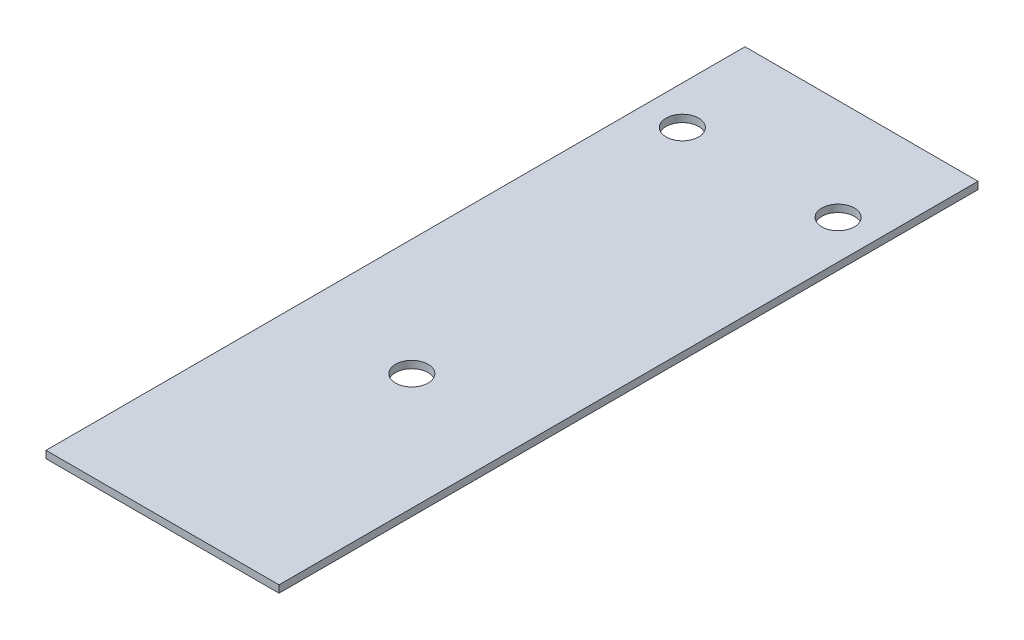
ISO-10303-21;
HEADER;
FILE_DESCRIPTION(('STEP AP214'),'2;1');
FILE_NAME('part.step','',(''),(''),'','','');
FILE_SCHEMA(('AUTOMOTIVE_DESIGN { 1 0 10303 214 1 1 1 1 }'));
ENDSEC;
DATA;
#1=APPLICATION_CONTEXT('core data for automotive mechanical design processes');
#2=APPLICATION_PROTOCOL_DEFINITION('international standard','automotive_design',2000,#1);
#3=PRODUCT_CONTEXT('',#1,'mechanical');
#4=PRODUCT('Part','Part','',(#3));
#5=PRODUCT_RELATED_PRODUCT_CATEGORY('part','',(#4));
#6=PRODUCT_DEFINITION_FORMATION('','',#4);
#7=PRODUCT_DEFINITION_CONTEXT('part definition',#1,'design');
#8=PRODUCT_DEFINITION('design','',#6,#7);
#9=PRODUCT_DEFINITION_SHAPE('','',#8);
#10=(LENGTH_UNIT() NAMED_UNIT(*) SI_UNIT(.MILLI.,.METRE.));
#11=(NAMED_UNIT(*) PLANE_ANGLE_UNIT() SI_UNIT($,.RADIAN.));
#12=(NAMED_UNIT(*) SI_UNIT($,.STERADIAN.) SOLID_ANGLE_UNIT());
#13=UNCERTAINTY_MEASURE_WITH_UNIT(LENGTH_MEASURE(1.E-05),#10,'distance_accuracy_value','');
#14=(GEOMETRIC_REPRESENTATION_CONTEXT(3) GLOBAL_UNCERTAINTY_ASSIGNED_CONTEXT((#13)) GLOBAL_UNIT_ASSIGNED_CONTEXT((#10,
#11,#12)) REPRESENTATION_CONTEXT('',''));
#15=CARTESIAN_POINT('',(0.,0.,0.));
#16=DIRECTION('',(0.,0.,1.));
#17=DIRECTION('',(1.,0.,0.));
#18=AXIS2_PLACEMENT_3D('',#15,#16,#17);
#19=CARTESIAN_POINT('',(76.2,4.7625,228.6));
#20=DIRECTION('',(-1.,0.,0.));
#21=DIRECTION('',(0.,0.,1.));
#22=AXIS2_PLACEMENT_3D('',#19,#20,#21);
#23=PLANE('',#22);
#24=DIRECTION('',(0.,0.,-1.));
#25=VECTOR('',#24,1.);
#26=CARTESIAN_POINT('',(76.2,0.,228.6));
#27=LINE('',#26,#25);
#28=CARTESIAN_POINT('',(76.2,0.,228.6));
#29=VERTEX_POINT('',#28);
#30=CARTESIAN_POINT('',(76.2,0.,-228.6));
#31=VERTEX_POINT('',#30);
#32=EDGE_CURVE('E111',#29,#31,#27,.T.);
#33=ORIENTED_EDGE('',*,*,#32,.T.);
#34=DIRECTION('',(0.,-1.,0.));
#35=VECTOR('',#34,1.);
#36=CARTESIAN_POINT('',(76.2,4.7625,-228.6));
#37=LINE('',#36,#35);
#38=CARTESIAN_POINT('',(76.2,4.7625,-228.6));
#39=VERTEX_POINT('',#38);
#40=EDGE_CURVE('E11',#39,#31,#37,.T.);
#41=ORIENTED_EDGE('',*,*,#40,.F.);
#42=DIRECTION('',(0.,0.,-1.));
#43=VECTOR('',#42,1.);
#44=CARTESIAN_POINT('',(76.2,4.7625,228.6));
#45=LINE('',#44,#43);
#46=CARTESIAN_POINT('',(76.2,4.7625,228.6));
#47=VERTEX_POINT('',#46);
#48=EDGE_CURVE('E95',#47,#39,#45,.T.);
#49=ORIENTED_EDGE('',*,*,#48,.F.);
#50=DIRECTION('',(0.,-1.,0.));
#51=VECTOR('',#50,1.);
#52=CARTESIAN_POINT('',(76.2,4.7625,228.6));
#53=LINE('',#52,#51);
#54=EDGE_CURVE('E107',#47,#29,#53,.T.);
#55=ORIENTED_EDGE('',*,*,#54,.T.);
#56=EDGE_LOOP('',(#33,#41,#49,#55));
#57=FACE_BOUND('',#56,.T.);
#58=ADVANCED_FACE('F43',(#57),#23,.F.);
#59=CARTESIAN_POINT('',(-76.2,4.7625,-228.6));
#60=DIRECTION('',(0.,0.,1.));
#61=DIRECTION('',(1.,0.,0.));
#62=AXIS2_PLACEMENT_3D('',#59,#60,#61);
#63=PLANE('',#62);
#64=DIRECTION('',(-1.,0.,0.));
#65=VECTOR('',#64,1.);
#66=CARTESIAN_POINT('',(-76.2,0.,-228.6));
#67=LINE('',#66,#65);
#68=CARTESIAN_POINT('',(-76.2,0.,-228.6));
#69=VERTEX_POINT('',#68);
#70=EDGE_CURVE('E100',#31,#69,#67,.T.);
#71=ORIENTED_EDGE('',*,*,#70,.T.);
#72=DIRECTION('',(0.,-1.,0.));
#73=VECTOR('',#72,1.);
#74=CARTESIAN_POINT('',(-76.2,4.7625,-228.6));
#75=LINE('',#74,#73);
#76=CARTESIAN_POINT('',(-76.2,4.7625,-228.6));
#77=VERTEX_POINT('',#76);
#78=EDGE_CURVE('E52',#77,#69,#75,.T.);
#79=ORIENTED_EDGE('',*,*,#78,.F.);
#80=DIRECTION('',(-1.,0.,0.));
#81=VECTOR('',#80,1.);
#82=CARTESIAN_POINT('',(-76.2,4.7625,-228.6));
#83=LINE('',#82,#81);
#84=EDGE_CURVE('E90',#39,#77,#83,.T.);
#85=ORIENTED_EDGE('',*,*,#84,.F.);
#86=ORIENTED_EDGE('',*,*,#40,.T.);
#87=EDGE_LOOP('',(#71,#79,#85,#86));
#88=FACE_BOUND('',#87,.T.);
#89=ADVANCED_FACE('F99',(#88),#63,.F.);
#90=CARTESIAN_POINT('',(-76.2,4.7625,228.6));
#91=DIRECTION('',(1.,0.,0.));
#92=DIRECTION('',(0.,0.,-1.));
#93=AXIS2_PLACEMENT_3D('',#90,#91,#92);
#94=PLANE('',#93);
#95=DIRECTION('',(0.,0.,1.));
#96=VECTOR('',#95,1.);
#97=CARTESIAN_POINT('',(-76.2,0.,228.6));
#98=LINE('',#97,#96);
#99=CARTESIAN_POINT('',(-76.2,0.,228.6));
#100=VERTEX_POINT('',#99);
#101=EDGE_CURVE('E77',#69,#100,#98,.T.);
#102=ORIENTED_EDGE('',*,*,#101,.T.);
#103=DIRECTION('',(0.,-1.,0.));
#104=VECTOR('',#103,1.);
#105=CARTESIAN_POINT('',(-76.2,4.7625,228.6));
#106=LINE('',#105,#104);
#107=CARTESIAN_POINT('',(-76.2,4.7625,228.6));
#108=VERTEX_POINT('',#107);
#109=EDGE_CURVE('E102',#108,#100,#106,.T.);
#110=ORIENTED_EDGE('',*,*,#109,.F.);
#111=DIRECTION('',(0.,0.,1.));
#112=VECTOR('',#111,1.);
#113=CARTESIAN_POINT('',(-76.2,4.7625,228.6));
#114=LINE('',#113,#112);
#115=EDGE_CURVE('E93',#77,#108,#114,.T.);
#116=ORIENTED_EDGE('',*,*,#115,.F.);
#117=ORIENTED_EDGE('',*,*,#78,.T.);
#118=EDGE_LOOP('',(#102,#110,#116,#117));
#119=FACE_BOUND('',#118,.T.);
#120=ADVANCED_FACE('F103',(#119),#94,.F.);
#121=CARTESIAN_POINT('',(-76.2,4.7625,228.6));
#122=DIRECTION('',(0.,0.,-1.));
#123=DIRECTION('',(-1.,0.,0.));
#124=AXIS2_PLACEMENT_3D('',#121,#122,#123);
#125=PLANE('',#124);
#126=DIRECTION('',(1.,0.,0.));
#127=VECTOR('',#126,1.);
#128=CARTESIAN_POINT('',(-76.2,0.,228.6));
#129=LINE('',#128,#127);
#130=EDGE_CURVE('E83',#100,#29,#129,.T.);
#131=ORIENTED_EDGE('',*,*,#130,.T.);
#132=ORIENTED_EDGE('',*,*,#54,.F.);
#133=DIRECTION('',(1.,0.,0.));
#134=VECTOR('',#133,1.);
#135=CARTESIAN_POINT('',(-76.2,4.7625,228.6));
#136=LINE('',#135,#134);
#137=EDGE_CURVE('E60',#108,#47,#136,.T.);
#138=ORIENTED_EDGE('',*,*,#137,.F.);
#139=ORIENTED_EDGE('',*,*,#109,.T.);
#140=EDGE_LOOP('',(#131,#132,#138,#139));
#141=FACE_BOUND('',#140,.T.);
#142=ADVANCED_FACE('F125',(#141),#125,.F.);
#143=CARTESIAN_POINT('',(0.,4.7625,0.));
#144=DIRECTION('',(0.,-1.,0.));
#145=DIRECTION('',(0.,0.,-1.));
#146=AXIS2_PLACEMENT_3D('',#143,#144,#145);
#147=PLANE('',#146);
#148=CARTESIAN_POINT('',(-50.927,4.7625,-162.3695));
#149=DIRECTION('',(0.,1.,0.));
#150=DIRECTION('',(0.,0.,1.));
#151=AXIS2_PLACEMENT_3D('',#148,#149,#150);
#152=CIRCLE('',#151,10.668);
#153=CARTESIAN_POINT('',(-50.927,4.7625,-151.7015));
#154=VERTEX_POINT('',#153);
#155=EDGE_CURVE('E148',#154,#154,#152,.T.);
#156=ORIENTED_EDGE('',*,*,#155,.F.);
#157=EDGE_LOOP('',(#156));
#158=FACE_BOUND('',#157,.T.);
#159=CARTESIAN_POINT('',(50.927,4.7625,-162.3695));
#160=DIRECTION('',(0.,1.,0.));
#161=DIRECTION('',(0.,0.,1.));
#162=AXIS2_PLACEMENT_3D('',#159,#160,#161);
#163=CIRCLE('',#162,10.668);
#164=CARTESIAN_POINT('',(50.927,4.7625,-151.7015));
#165=VERTEX_POINT('',#164);
#166=EDGE_CURVE('E144',#165,#165,#163,.T.);
#167=ORIENTED_EDGE('',*,*,#166,.F.);
#168=EDGE_LOOP('',(#167));
#169=FACE_BOUND('',#168,.T.);
#170=CARTESIAN_POINT('',(0.,4.7625,65.5320000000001));
#171=DIRECTION('',(0.,1.,0.));
#172=DIRECTION('',(0.,0.,1.));
#173=AXIS2_PLACEMENT_3D('',#170,#171,#172);
#174=CIRCLE('',#173,10.668);
#175=CARTESIAN_POINT('',(0.,4.7625,76.2000000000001));
#176=VERTEX_POINT('',#175);
#177=EDGE_CURVE('E136',#176,#176,#174,.T.);
#178=ORIENTED_EDGE('',*,*,#177,.F.);
#179=EDGE_LOOP('',(#178));
#180=FACE_BOUND('',#179,.T.);
#181=ORIENTED_EDGE('',*,*,#48,.T.);
#182=ORIENTED_EDGE('',*,*,#84,.T.);
#183=ORIENTED_EDGE('',*,*,#115,.T.);
#184=ORIENTED_EDGE('',*,*,#137,.T.);
#185=EDGE_LOOP('',(#181,#182,#183,#184));
#186=FACE_BOUND('',#185,.T.);
#187=ADVANCED_FACE('F91',(#158,#169,#180,#186),#147,.F.);
#188=CARTESIAN_POINT('',(0.,0.,0.));
#189=DIRECTION('',(0.,-1.,0.));
#190=DIRECTION('',(0.,0.,-1.));
#191=AXIS2_PLACEMENT_3D('',#188,#189,#190);
#192=PLANE('',#191);
#193=CARTESIAN_POINT('',(-50.927,0.,-162.3695));
#194=DIRECTION('',(0.,1.,0.));
#195=DIRECTION('',(0.,0.,1.));
#196=AXIS2_PLACEMENT_3D('',#193,#194,#195);
#197=CIRCLE('',#196,10.668);
#198=CARTESIAN_POINT('',(-50.927,0.,-151.7015));
#199=VERTEX_POINT('',#198);
#200=EDGE_CURVE('E115',#199,#199,#197,.T.);
#201=ORIENTED_EDGE('',*,*,#200,.T.);
#202=EDGE_LOOP('',(#201));
#203=FACE_BOUND('',#202,.T.);
#204=CARTESIAN_POINT('',(50.927,0.,-162.3695));
#205=DIRECTION('',(0.,1.,0.));
#206=DIRECTION('',(0.,0.,1.));
#207=AXIS2_PLACEMENT_3D('',#204,#205,#206);
#208=CIRCLE('',#207,10.668);
#209=CARTESIAN_POINT('',(50.927,0.,-151.7015));
#210=VERTEX_POINT('',#209);
#211=EDGE_CURVE('E140',#210,#210,#208,.T.);
#212=ORIENTED_EDGE('',*,*,#211,.T.);
#213=EDGE_LOOP('',(#212));
#214=FACE_BOUND('',#213,.T.);
#215=CARTESIAN_POINT('',(0.,0.,65.5320000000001));
#216=DIRECTION('',(0.,1.,0.));
#217=DIRECTION('',(0.,0.,1.));
#218=AXIS2_PLACEMENT_3D('',#215,#216,#217);
#219=CIRCLE('',#218,10.668);
#220=CARTESIAN_POINT('',(0.,0.,76.2000000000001));
#221=VERTEX_POINT('',#220);
#222=EDGE_CURVE('E132',#221,#221,#219,.T.);
#223=ORIENTED_EDGE('',*,*,#222,.T.);
#224=EDGE_LOOP('',(#223));
#225=FACE_BOUND('',#224,.T.);
#226=ORIENTED_EDGE('',*,*,#32,.F.);
#227=ORIENTED_EDGE('',*,*,#130,.F.);
#228=ORIENTED_EDGE('',*,*,#101,.F.);
#229=ORIENTED_EDGE('',*,*,#70,.F.);
#230=EDGE_LOOP('',(#226,#227,#228,#229));
#231=FACE_BOUND('',#230,.T.);
#232=ADVANCED_FACE('F128',(#203,#214,#225,#231),#192,.T.);
#233=CARTESIAN_POINT('',(0.,0.,65.5320000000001));
#234=DIRECTION('',(0.,1.,0.));
#235=DIRECTION('',(0.,0.,1.));
#236=AXIS2_PLACEMENT_3D('',#233,#234,#235);
#237=CYLINDRICAL_SURFACE('',#236,10.668);
#238=CARTESIAN_POINT('',(0.,0.,76.2000000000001));
#239=CARTESIAN_POINT('',(0.,0.049609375,76.2000000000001));
#240=CARTESIAN_POINT('',(0.,0.09921875,76.2000000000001));
#241=CARTESIAN_POINT('',(0.,0.1984375,76.2000000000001));
#242=CARTESIAN_POINT('',(0.,0.248046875,76.2000000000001));
#243=CARTESIAN_POINT('',(0.,0.347265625,76.2000000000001));
#244=CARTESIAN_POINT('',(0.,0.396875,76.2000000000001));
#245=CARTESIAN_POINT('',(0.,0.49609375,76.2000000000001));
#246=CARTESIAN_POINT('',(0.,0.545703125,76.2000000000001));
#247=CARTESIAN_POINT('',(0.,0.644921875,76.2000000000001));
#248=CARTESIAN_POINT('',(0.,0.69453125,76.2000000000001));
#249=CARTESIAN_POINT('',(0.,0.79375,76.2000000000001));
#250=CARTESIAN_POINT('',(0.,0.843359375,76.2000000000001));
#251=CARTESIAN_POINT('',(0.,0.942578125,76.2000000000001));
#252=CARTESIAN_POINT('',(0.,0.9921875,76.2000000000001));
#253=CARTESIAN_POINT('',(0.,1.09140625,76.2000000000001));
#254=CARTESIAN_POINT('',(0.,1.141015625,76.2000000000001));
#255=CARTESIAN_POINT('',(0.,1.240234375,76.2000000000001));
#256=CARTESIAN_POINT('',(0.,1.28984375,76.2000000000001));
#257=CARTESIAN_POINT('',(0.,1.3890625,76.2000000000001));
#258=CARTESIAN_POINT('',(0.,1.438671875,76.2000000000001));
#259=CARTESIAN_POINT('',(0.,1.537890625,76.2000000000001));
#260=CARTESIAN_POINT('',(0.,1.5875,76.2000000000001));
#261=CARTESIAN_POINT('',(0.,1.68671875,76.2000000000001));
#262=CARTESIAN_POINT('',(0.,1.736328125,76.2000000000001));
#263=CARTESIAN_POINT('',(0.,1.835546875,76.2000000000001));
#264=CARTESIAN_POINT('',(0.,1.88515625,76.2000000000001));
#265=CARTESIAN_POINT('',(0.,1.984375,76.2000000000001));
#266=CARTESIAN_POINT('',(0.,2.033984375,76.2000000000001));
#267=CARTESIAN_POINT('',(0.,2.133203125,76.2000000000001));
#268=CARTESIAN_POINT('',(0.,2.1828125,76.2000000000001));
#269=CARTESIAN_POINT('',(0.,2.28203125,76.2000000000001));
#270=CARTESIAN_POINT('',(0.,2.331640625,76.2000000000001));
#271=CARTESIAN_POINT('',(0.,2.430859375,76.2000000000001));
#272=CARTESIAN_POINT('',(0.,2.48046875,76.2000000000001));
#273=CARTESIAN_POINT('',(0.,2.5796875,76.2000000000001));
#274=CARTESIAN_POINT('',(0.,2.629296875,76.2000000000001));
#275=CARTESIAN_POINT('',(0.,2.728515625,76.2000000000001));
#276=CARTESIAN_POINT('',(0.,2.778125,76.2000000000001));
#277=CARTESIAN_POINT('',(0.,2.87734375,76.2000000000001));
#278=CARTESIAN_POINT('',(0.,2.926953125,76.2000000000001));
#279=CARTESIAN_POINT('',(0.,3.026171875,76.2000000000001));
#280=CARTESIAN_POINT('',(0.,3.07578125,76.2000000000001));
#281=CARTESIAN_POINT('',(0.,3.175,76.2000000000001));
#282=CARTESIAN_POINT('',(0.,3.224609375,76.2000000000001));
#283=CARTESIAN_POINT('',(0.,3.323828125,76.2000000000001));
#284=CARTESIAN_POINT('',(0.,3.3734375,76.2000000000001));
#285=CARTESIAN_POINT('',(0.,3.47265625,76.2000000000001));
#286=CARTESIAN_POINT('',(0.,3.522265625,76.2000000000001));
#287=CARTESIAN_POINT('',(0.,3.621484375,76.2000000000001));
#288=CARTESIAN_POINT('',(0.,3.67109375,76.2000000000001));
#289=CARTESIAN_POINT('',(0.,3.7703125,76.2000000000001));
#290=CARTESIAN_POINT('',(0.,3.819921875,76.2000000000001));
#291=CARTESIAN_POINT('',(0.,3.919140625,76.2000000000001));
#292=CARTESIAN_POINT('',(0.,3.96875,76.2000000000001));
#293=CARTESIAN_POINT('',(0.,4.06796875,76.2000000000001));
#294=CARTESIAN_POINT('',(0.,4.117578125,76.2000000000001));
#295=CARTESIAN_POINT('',(0.,4.216796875,76.2000000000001));
#296=CARTESIAN_POINT('',(0.,4.26640625,76.2000000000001));
#297=CARTESIAN_POINT('',(0.,4.365625,76.2000000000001));
#298=CARTESIAN_POINT('',(0.,4.415234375,76.2000000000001));
#299=CARTESIAN_POINT('',(0.,4.514453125,76.2000000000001));
#300=CARTESIAN_POINT('',(0.,4.5640625,76.2000000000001));
#301=CARTESIAN_POINT('',(0.,4.66328125,76.2000000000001));
#302=CARTESIAN_POINT('',(0.,4.712890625,76.2000000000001));
#303=CARTESIAN_POINT('',(0.,4.7625,76.2000000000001));
#304=B_SPLINE_CURVE_WITH_KNOTS('',3,(#238,#239,#240,#241,#242,#243,#244,#245,#246,#247,#248,
#249,#250,#251,#252,#253,#254,#255,#256,#257,#258,#259,#260,#261,#262,#263,#264,#265,#266,#267,
#268,#269,#270,#271,#272,#273,#274,#275,#276,#277,#278,#279,#280,#281,#282,#283,#284,#285,#286,
#287,#288,#289,#290,#291,#292,#293,#294,#295,#296,#297,#298,#299,#300,#301,#302,#303),
.UNSPECIFIED.,.F.,.F.,(4,2,2,2,2,2,2,2,2,2,2,2,2,2,2,2,2,2,2,2,2,2,2,2,2,2,2,2,2,2,2,2,4),(0.,
0.148828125,0.29765625,0.446484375,0.5953125,0.744140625,0.89296875,1.041796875,1.190625,
1.339453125,1.48828125,1.637109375,1.7859375,1.934765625,2.08359375,2.232421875,2.38125,
2.530078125,2.67890625,2.827734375,2.9765625,3.125390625,3.27421875,3.423046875,3.571875,
3.720703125,3.86953125,4.018359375,4.1671875,4.316015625,4.46484375,4.613671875,4.7625),.UNSPECIFIED.);
#305=EDGE_CURVE('BSEAM172',#221,#176,#304,.T.);
#306=ORIENTED_EDGE('',*,*,#222,.F.);
#307=ORIENTED_EDGE('',*,*,#177,.T.);
#308=ORIENTED_EDGE('',*,*,#305,.T.);
#309=ORIENTED_EDGE('',*,*,#305,.F.);
#310=EDGE_LOOP('',(#306,#308,#307,#309));
#311=FACE_BOUND('',#310,.T.);
#312=ADVANCED_FACE('F172',(#311),#237,.F.);
#313=CARTESIAN_POINT('',(50.927,0.,-162.3695));
#314=DIRECTION('',(0.,1.,0.));
#315=DIRECTION('',(0.,0.,1.));
#316=AXIS2_PLACEMENT_3D('',#313,#314,#315);
#317=CYLINDRICAL_SURFACE('',#316,10.668);
#318=CARTESIAN_POINT('',(50.927,0.,-151.7015));
#319=CARTESIAN_POINT('',(50.927,0.049609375,-151.7015));
#320=CARTESIAN_POINT('',(50.927,0.09921875,-151.7015));
#321=CARTESIAN_POINT('',(50.927,0.1984375,-151.7015));
#322=CARTESIAN_POINT('',(50.927,0.248046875,-151.7015));
#323=CARTESIAN_POINT('',(50.927,0.347265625,-151.7015));
#324=CARTESIAN_POINT('',(50.927,0.396875,-151.7015));
#325=CARTESIAN_POINT('',(50.927,0.49609375,-151.7015));
#326=CARTESIAN_POINT('',(50.927,0.545703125,-151.7015));
#327=CARTESIAN_POINT('',(50.927,0.644921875,-151.7015));
#328=CARTESIAN_POINT('',(50.927,0.69453125,-151.7015));
#329=CARTESIAN_POINT('',(50.927,0.79375,-151.7015));
#330=CARTESIAN_POINT('',(50.927,0.843359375,-151.7015));
#331=CARTESIAN_POINT('',(50.927,0.942578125,-151.7015));
#332=CARTESIAN_POINT('',(50.927,0.9921875,-151.7015));
#333=CARTESIAN_POINT('',(50.927,1.09140625,-151.7015));
#334=CARTESIAN_POINT('',(50.927,1.141015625,-151.7015));
#335=CARTESIAN_POINT('',(50.927,1.240234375,-151.7015));
#336=CARTESIAN_POINT('',(50.927,1.28984375,-151.7015));
#337=CARTESIAN_POINT('',(50.927,1.3890625,-151.7015));
#338=CARTESIAN_POINT('',(50.927,1.438671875,-151.7015));
#339=CARTESIAN_POINT('',(50.927,1.537890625,-151.7015));
#340=CARTESIAN_POINT('',(50.927,1.5875,-151.7015));
#341=CARTESIAN_POINT('',(50.927,1.68671875,-151.7015));
#342=CARTESIAN_POINT('',(50.927,1.736328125,-151.7015));
#343=CARTESIAN_POINT('',(50.927,1.835546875,-151.7015));
#344=CARTESIAN_POINT('',(50.927,1.88515625,-151.7015));
#345=CARTESIAN_POINT('',(50.927,1.984375,-151.7015));
#346=CARTESIAN_POINT('',(50.927,2.033984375,-151.7015));
#347=CARTESIAN_POINT('',(50.927,2.133203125,-151.7015));
#348=CARTESIAN_POINT('',(50.927,2.1828125,-151.7015));
#349=CARTESIAN_POINT('',(50.927,2.28203125,-151.7015));
#350=CARTESIAN_POINT('',(50.927,2.331640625,-151.7015));
#351=CARTESIAN_POINT('',(50.927,2.430859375,-151.7015));
#352=CARTESIAN_POINT('',(50.927,2.48046875,-151.7015));
#353=CARTESIAN_POINT('',(50.927,2.5796875,-151.7015));
#354=CARTESIAN_POINT('',(50.927,2.629296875,-151.7015));
#355=CARTESIAN_POINT('',(50.927,2.728515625,-151.7015));
#356=CARTESIAN_POINT('',(50.927,2.778125,-151.7015));
#357=CARTESIAN_POINT('',(50.927,2.87734375,-151.7015));
#358=CARTESIAN_POINT('',(50.927,2.926953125,-151.7015));
#359=CARTESIAN_POINT('',(50.927,3.026171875,-151.7015));
#360=CARTESIAN_POINT('',(50.927,3.07578125,-151.7015));
#361=CARTESIAN_POINT('',(50.927,3.175,-151.7015));
#362=CARTESIAN_POINT('',(50.927,3.224609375,-151.7015));
#363=CARTESIAN_POINT('',(50.927,3.323828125,-151.7015));
#364=CARTESIAN_POINT('',(50.927,3.3734375,-151.7015));
#365=CARTESIAN_POINT('',(50.927,3.47265625,-151.7015));
#366=CARTESIAN_POINT('',(50.927,3.522265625,-151.7015));
#367=CARTESIAN_POINT('',(50.927,3.621484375,-151.7015));
#368=CARTESIAN_POINT('',(50.927,3.67109375,-151.7015));
#369=CARTESIAN_POINT('',(50.927,3.7703125,-151.7015));
#370=CARTESIAN_POINT('',(50.927,3.819921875,-151.7015));
#371=CARTESIAN_POINT('',(50.927,3.919140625,-151.7015));
#372=CARTESIAN_POINT('',(50.927,3.96875,-151.7015));
#373=CARTESIAN_POINT('',(50.927,4.06796875,-151.7015));
#374=CARTESIAN_POINT('',(50.927,4.117578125,-151.7015));
#375=CARTESIAN_POINT('',(50.927,4.216796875,-151.7015));
#376=CARTESIAN_POINT('',(50.927,4.26640625,-151.7015));
#377=CARTESIAN_POINT('',(50.927,4.365625,-151.7015));
#378=CARTESIAN_POINT('',(50.927,4.415234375,-151.7015));
#379=CARTESIAN_POINT('',(50.927,4.514453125,-151.7015));
#380=CARTESIAN_POINT('',(50.927,4.5640625,-151.7015));
#381=CARTESIAN_POINT('',(50.927,4.66328125,-151.7015));
#382=CARTESIAN_POINT('',(50.927,4.712890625,-151.7015));
#383=CARTESIAN_POINT('',(50.927,4.7625,-151.7015));
#384=B_SPLINE_CURVE_WITH_KNOTS('',3,(#318,#319,#320,#321,#322,#323,#324,#325,#326,#327,#328,
#329,#330,#331,#332,#333,#334,#335,#336,#337,#338,#339,#340,#341,#342,#343,#344,#345,#346,#347,
#348,#349,#350,#351,#352,#353,#354,#355,#356,#357,#358,#359,#360,#361,#362,#363,#364,#365,#366,
#367,#368,#369,#370,#371,#372,#373,#374,#375,#376,#377,#378,#379,#380,#381,#382,#383),
.UNSPECIFIED.,.F.,.F.,(4,2,2,2,2,2,2,2,2,2,2,2,2,2,2,2,2,2,2,2,2,2,2,2,2,2,2,2,2,2,2,2,4),(0.,
0.148828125,0.29765625,0.446484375,0.5953125,0.744140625,0.89296875,1.041796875,1.190625,
1.339453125,1.48828125,1.637109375,1.7859375,1.934765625,2.08359375,2.232421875,2.38125,
2.530078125,2.67890625,2.827734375,2.9765625,3.125390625,3.27421875,3.423046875,3.571875,
3.720703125,3.86953125,4.018359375,4.1671875,4.316015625,4.46484375,4.613671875,4.7625),.UNSPECIFIED.);
#385=EDGE_CURVE('BSEAM161',#210,#165,#384,.T.);
#386=ORIENTED_EDGE('',*,*,#211,.F.);
#387=ORIENTED_EDGE('',*,*,#166,.T.);
#388=ORIENTED_EDGE('',*,*,#385,.T.);
#389=ORIENTED_EDGE('',*,*,#385,.F.);
#390=EDGE_LOOP('',(#386,#388,#387,#389));
#391=FACE_BOUND('',#390,.T.);
#392=ADVANCED_FACE('F161',(#391),#317,.F.);
#393=CARTESIAN_POINT('',(-50.927,0.,-162.3695));
#394=DIRECTION('',(0.,1.,0.));
#395=DIRECTION('',(0.,0.,1.));
#396=AXIS2_PLACEMENT_3D('',#393,#394,#395);
#397=CYLINDRICAL_SURFACE('',#396,10.668);
#398=CARTESIAN_POINT('',(-50.927,0.,-151.7015));
#399=CARTESIAN_POINT('',(-50.927,0.049609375,-151.7015));
#400=CARTESIAN_POINT('',(-50.927,0.09921875,-151.7015));
#401=CARTESIAN_POINT('',(-50.927,0.1984375,-151.7015));
#402=CARTESIAN_POINT('',(-50.927,0.248046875,-151.7015));
#403=CARTESIAN_POINT('',(-50.927,0.347265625,-151.7015));
#404=CARTESIAN_POINT('',(-50.927,0.396875,-151.7015));
#405=CARTESIAN_POINT('',(-50.927,0.49609375,-151.7015));
#406=CARTESIAN_POINT('',(-50.927,0.545703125,-151.7015));
#407=CARTESIAN_POINT('',(-50.927,0.644921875,-151.7015));
#408=CARTESIAN_POINT('',(-50.927,0.69453125,-151.7015));
#409=CARTESIAN_POINT('',(-50.927,0.79375,-151.7015));
#410=CARTESIAN_POINT('',(-50.927,0.843359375,-151.7015));
#411=CARTESIAN_POINT('',(-50.927,0.942578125,-151.7015));
#412=CARTESIAN_POINT('',(-50.927,0.9921875,-151.7015));
#413=CARTESIAN_POINT('',(-50.927,1.09140625,-151.7015));
#414=CARTESIAN_POINT('',(-50.927,1.141015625,-151.7015));
#415=CARTESIAN_POINT('',(-50.927,1.240234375,-151.7015));
#416=CARTESIAN_POINT('',(-50.927,1.28984375,-151.7015));
#417=CARTESIAN_POINT('',(-50.927,1.3890625,-151.7015));
#418=CARTESIAN_POINT('',(-50.927,1.438671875,-151.7015));
#419=CARTESIAN_POINT('',(-50.927,1.537890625,-151.7015));
#420=CARTESIAN_POINT('',(-50.927,1.5875,-151.7015));
#421=CARTESIAN_POINT('',(-50.927,1.68671875,-151.7015));
#422=CARTESIAN_POINT('',(-50.927,1.736328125,-151.7015));
#423=CARTESIAN_POINT('',(-50.927,1.835546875,-151.7015));
#424=CARTESIAN_POINT('',(-50.927,1.88515625,-151.7015));
#425=CARTESIAN_POINT('',(-50.927,1.984375,-151.7015));
#426=CARTESIAN_POINT('',(-50.927,2.033984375,-151.7015));
#427=CARTESIAN_POINT('',(-50.927,2.133203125,-151.7015));
#428=CARTESIAN_POINT('',(-50.927,2.1828125,-151.7015));
#429=CARTESIAN_POINT('',(-50.927,2.28203125,-151.7015));
#430=CARTESIAN_POINT('',(-50.927,2.331640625,-151.7015));
#431=CARTESIAN_POINT('',(-50.927,2.430859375,-151.7015));
#432=CARTESIAN_POINT('',(-50.927,2.48046875,-151.7015));
#433=CARTESIAN_POINT('',(-50.927,2.5796875,-151.7015));
#434=CARTESIAN_POINT('',(-50.927,2.629296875,-151.7015));
#435=CARTESIAN_POINT('',(-50.927,2.728515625,-151.7015));
#436=CARTESIAN_POINT('',(-50.927,2.778125,-151.7015));
#437=CARTESIAN_POINT('',(-50.927,2.87734375,-151.7015));
#438=CARTESIAN_POINT('',(-50.927,2.926953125,-151.7015));
#439=CARTESIAN_POINT('',(-50.927,3.026171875,-151.7015));
#440=CARTESIAN_POINT('',(-50.927,3.07578125,-151.7015));
#441=CARTESIAN_POINT('',(-50.927,3.175,-151.7015));
#442=CARTESIAN_POINT('',(-50.927,3.224609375,-151.7015));
#443=CARTESIAN_POINT('',(-50.927,3.323828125,-151.7015));
#444=CARTESIAN_POINT('',(-50.927,3.3734375,-151.7015));
#445=CARTESIAN_POINT('',(-50.927,3.47265625,-151.7015));
#446=CARTESIAN_POINT('',(-50.927,3.522265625,-151.7015));
#447=CARTESIAN_POINT('',(-50.927,3.621484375,-151.7015));
#448=CARTESIAN_POINT('',(-50.927,3.67109375,-151.7015));
#449=CARTESIAN_POINT('',(-50.927,3.7703125,-151.7015));
#450=CARTESIAN_POINT('',(-50.927,3.819921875,-151.7015));
#451=CARTESIAN_POINT('',(-50.927,3.919140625,-151.7015));
#452=CARTESIAN_POINT('',(-50.927,3.96875,-151.7015));
#453=CARTESIAN_POINT('',(-50.927,4.06796875,-151.7015));
#454=CARTESIAN_POINT('',(-50.927,4.117578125,-151.7015));
#455=CARTESIAN_POINT('',(-50.927,4.216796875,-151.7015));
#456=CARTESIAN_POINT('',(-50.927,4.26640625,-151.7015));
#457=CARTESIAN_POINT('',(-50.927,4.365625,-151.7015));
#458=CARTESIAN_POINT('',(-50.927,4.415234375,-151.7015));
#459=CARTESIAN_POINT('',(-50.927,4.514453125,-151.7015));
#460=CARTESIAN_POINT('',(-50.927,4.5640625,-151.7015));
#461=CARTESIAN_POINT('',(-50.927,4.66328125,-151.7015));
#462=CARTESIAN_POINT('',(-50.927,4.712890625,-151.7015));
#463=CARTESIAN_POINT('',(-50.927,4.7625,-151.7015));
#464=B_SPLINE_CURVE_WITH_KNOTS('',3,(#398,#399,#400,#401,#402,#403,#404,#405,#406,#407,#408,
#409,#410,#411,#412,#413,#414,#415,#416,#417,#418,#419,#420,#421,#422,#423,#424,#425,#426,#427,
#428,#429,#430,#431,#432,#433,#434,#435,#436,#437,#438,#439,#440,#441,#442,#443,#444,#445,#446,
#447,#448,#449,#450,#451,#452,#453,#454,#455,#456,#457,#458,#459,#460,#461,#462,#463),
.UNSPECIFIED.,.F.,.F.,(4,2,2,2,2,2,2,2,2,2,2,2,2,2,2,2,2,2,2,2,2,2,2,2,2,2,2,2,2,2,2,2,4),(0.,
0.148828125,0.29765625,0.446484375,0.5953125,0.744140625,0.89296875,1.041796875,1.190625,
1.339453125,1.48828125,1.637109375,1.7859375,1.934765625,2.08359375,2.232421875,2.38125,
2.530078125,2.67890625,2.827734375,2.9765625,3.125390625,3.27421875,3.423046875,3.571875,
3.720703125,3.86953125,4.018359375,4.1671875,4.316015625,4.46484375,4.613671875,4.7625),.UNSPECIFIED.);
#465=EDGE_CURVE('BSEAM158',#199,#154,#464,.T.);
#466=ORIENTED_EDGE('',*,*,#200,.F.);
#467=ORIENTED_EDGE('',*,*,#155,.T.);
#468=ORIENTED_EDGE('',*,*,#465,.T.);
#469=ORIENTED_EDGE('',*,*,#465,.F.);
#470=EDGE_LOOP('',(#466,#468,#467,#469));
#471=FACE_BOUND('',#470,.T.);
#472=ADVANCED_FACE('F158',(#471),#397,.F.);
#473=CLOSED_SHELL('',(#58,#89,#120,#142,#187,#232,#312,#392,#472));
#474=MANIFOLD_SOLID_BREP('B2',#473);
#475=ADVANCED_BREP_SHAPE_REPRESENTATION('',(#18,#474),#14);
#476=SHAPE_DEFINITION_REPRESENTATION(#9,#475);
ENDSEC;
END-ISO-10303-21;
